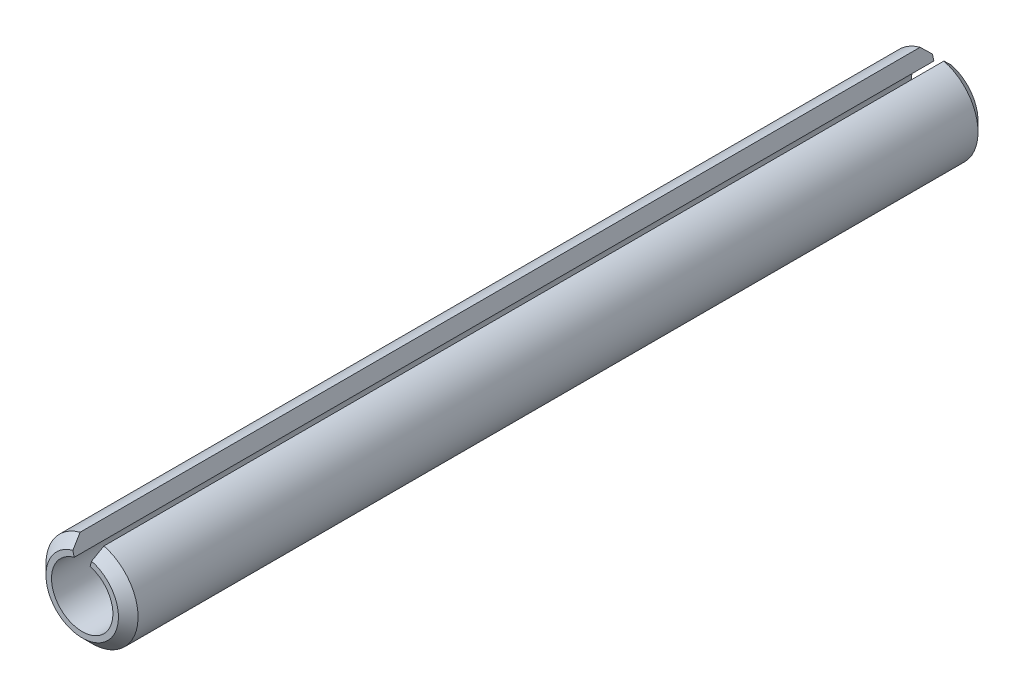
from build123d import *

# Parameters (mm, degrees)
EXTRUDE1_DEPTH = 11.1125
CHAMFER1_SIZE  = 0.254


with BuildPart() as part:
    # Sketch1 → Extrude1 (new, symmetric)
    with BuildSketch(Plane.XY):
        with BuildLine():
            Line((0.205437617, 0.766703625), (0.308156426, 1.150055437))
            ThreePointArc((0.308156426, 1.150055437), (0, -1.190625), (-0.308156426, 1.150055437))
            Line((-0.308156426, 1.150055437), (-0.205437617, 0.766703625))
            ThreePointArc((-0.205437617, 0.766703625), (0, -0.79375), (0.205437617, 0.766703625))
        make_face()
    extrude(amount=EXTRUDE1_DEPTH, both=True)

    # Chamfer1
    chamfer1_edges = [part.edges().sort_by_distance(p)[0] for p in [
        (0, -1.190625, 11.1125),
        (0, -1.190625, -11.1125),
    ]]
    chamfer(chamfer1_edges, length=CHAMFER1_SIZE)


solid = part.part
